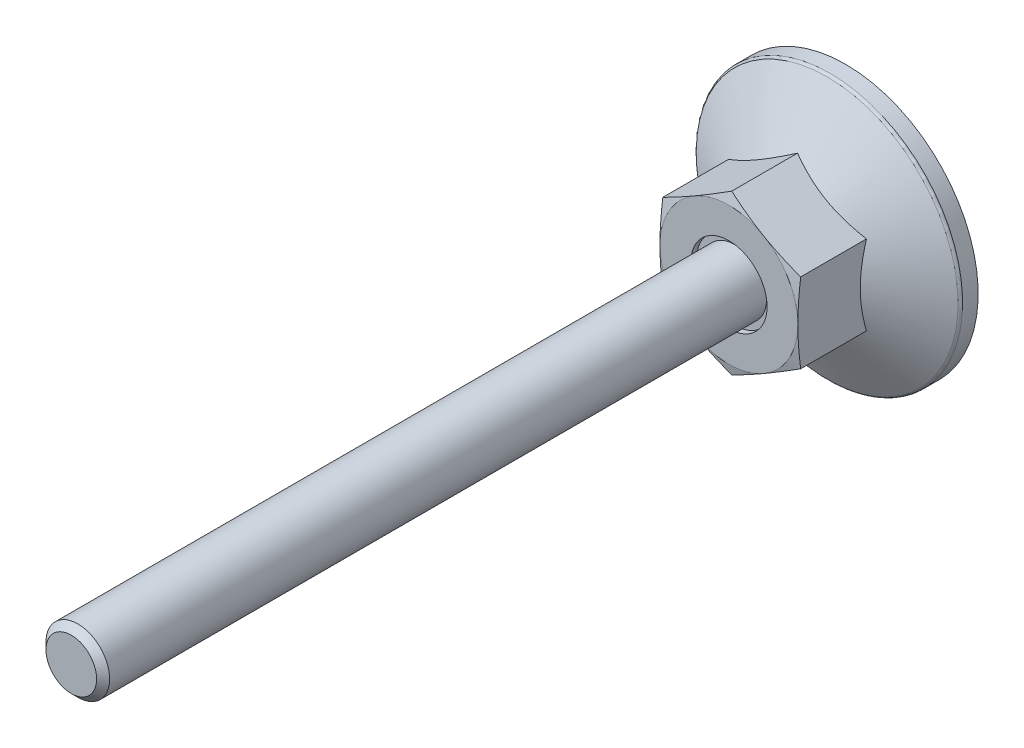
ISO-10303-21;
HEADER;
FILE_DESCRIPTION(('STEP AP214'),'2;1');
FILE_NAME('part.step','',(''),(''),'','','');
FILE_SCHEMA(('AUTOMOTIVE_DESIGN { 1 0 10303 214 1 1 1 1 }'));
ENDSEC;
DATA;
#1=APPLICATION_CONTEXT('core data for automotive mechanical design processes');
#2=APPLICATION_PROTOCOL_DEFINITION('international standard','automotive_design',2000,#1);
#3=PRODUCT_CONTEXT('',#1,'mechanical');
#4=PRODUCT('Part','Part','',(#3));
#5=PRODUCT_RELATED_PRODUCT_CATEGORY('part','',(#4));
#6=PRODUCT_DEFINITION_FORMATION('','',#4);
#7=PRODUCT_DEFINITION_CONTEXT('part definition',#1,'design');
#8=PRODUCT_DEFINITION('design','',#6,#7);
#9=PRODUCT_DEFINITION_SHAPE('','',#8);
#10=(LENGTH_UNIT() NAMED_UNIT(*) SI_UNIT(.MILLI.,.METRE.));
#11=(NAMED_UNIT(*) PLANE_ANGLE_UNIT() SI_UNIT($,.RADIAN.));
#12=(NAMED_UNIT(*) SI_UNIT($,.STERADIAN.) SOLID_ANGLE_UNIT());
#13=UNCERTAINTY_MEASURE_WITH_UNIT(LENGTH_MEASURE(1.E-05),#10,'distance_accuracy_value','');
#14=(GEOMETRIC_REPRESENTATION_CONTEXT(3) GLOBAL_UNCERTAINTY_ASSIGNED_CONTEXT((#13)) GLOBAL_UNIT_ASSIGNED_CONTEXT((#10,
#11,#12)) REPRESENTATION_CONTEXT('',''));
#15=CARTESIAN_POINT('',(0.,0.,0.));
#16=DIRECTION('',(0.,0.,1.));
#17=DIRECTION('',(1.,0.,0.));
#18=AXIS2_PLACEMENT_3D('',#15,#16,#17);
#19=CARTESIAN_POINT('',(0.,0.,10.45));
#20=DIRECTION('',(0.,0.,-1.));
#21=DIRECTION('',(0.,1.,0.));
#22=AXIS2_PLACEMENT_3D('',#19,#20,#21);
#23=PLANE('',#22);
#24=CARTESIAN_POINT('',(0.,0.,10.45));
#25=DIRECTION('',(0.,0.,-1.));
#26=DIRECTION('',(0.,1.,0.));
#27=AXIS2_PLACEMENT_3D('',#24,#25,#26);
#28=CIRCLE('',#27,3.6);
#29=CARTESIAN_POINT('',(0.,3.6,10.45));
#30=VERTEX_POINT('',#29);
#31=EDGE_CURVE('E27',#30,#30,#28,.T.);
#32=ORIENTED_EDGE('',*,*,#31,.F.);
#33=EDGE_LOOP('',(#32));
#34=FACE_BOUND('',#33,.T.);
#35=CARTESIAN_POINT('',(0.,0.,10.45));
#36=DIRECTION('',(0.,0.,-1.));
#37=DIRECTION('',(0.,1.,0.));
#38=AXIS2_PLACEMENT_3D('',#35,#36,#37);
#39=CIRCLE('',#38,3.);
#40=CARTESIAN_POINT('',(0.,3.,10.45));
#41=VERTEX_POINT('',#40);
#42=EDGE_CURVE('E252',#41,#41,#39,.F.);
#43=ORIENTED_EDGE('',*,*,#42,.F.);
#44=EDGE_LOOP('',(#43));
#45=FACE_BOUND('',#44,.T.);
#46=ADVANCED_FACE('F14',(#34,#45),#23,.F.);
#47=CARTESIAN_POINT('',(0.,7.5055534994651,22.));
#48=DIRECTION('',(0.499999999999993,-0.866025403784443,0.));
#49=DIRECTION('',(0.866025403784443,0.499999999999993,0.));
#50=AXIS2_PLACEMENT_3D('',#47,#48,#49);
#51=PLANE('',#50);
#52=CARTESIAN_POINT('',(-6.5002,3.75266127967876,4.53347836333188));
#53=CARTESIAN_POINT('',(-6.35732254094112,3.83515161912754,4.58109719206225));
#54=CARTESIAN_POINT('',(-6.21391236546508,3.91794952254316,4.62655491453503));
#55=CARTESIAN_POINT('',(-5.9259273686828,4.08421773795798,4.71255293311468));
#56=CARTESIAN_POINT('',(-5.78135207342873,4.16768832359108,4.7530911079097));
#57=CARTESIAN_POINT('',(-5.34531134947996,4.41943655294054,4.86653061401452));
#58=CARTESIAN_POINT('',(-5.05212471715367,4.58870793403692,4.93105380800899));
#59=CARTESIAN_POINT('',(-4.61337625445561,4.84201947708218,5.00671503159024));
#60=CARTESIAN_POINT('',(-4.46912536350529,4.92530276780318,5.02826875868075));
#61=CARTESIAN_POINT('',(-4.17997178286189,5.09224566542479,5.06441130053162));
#62=CARTESIAN_POINT('',(-4.03506915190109,5.17590523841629,5.07900073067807));
#63=CARTESIAN_POINT('',(-3.74501222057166,5.34336968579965,5.10084286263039));
#64=CARTESIAN_POINT('',(-3.59985839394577,5.42717428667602,5.10810389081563));
#65=CARTESIAN_POINT('',(-3.30942466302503,5.59485627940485,5.11514131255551));
#66=CARTESIAN_POINT('',(-3.16414476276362,5.67873366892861,5.11491793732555));
#67=CARTESIAN_POINT('',(-2.76612405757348,5.90853103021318,5.1040181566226));
#68=CARTESIAN_POINT('',(-2.51351353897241,6.05437578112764,5.08571979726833));
#69=CARTESIAN_POINT('',(-2.00997032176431,6.34509659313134,5.02769527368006));
#70=CARTESIAN_POINT('',(-1.75903939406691,6.48997163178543,4.9879492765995));
#71=CARTESIAN_POINT('',(-1.25448277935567,6.78127752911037,4.8885957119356));
#72=CARTESIAN_POINT('',(-1.00092075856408,6.92767163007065,4.82856718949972));
#73=CARTESIAN_POINT('',(-0.497578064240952,7.21827667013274,4.69232662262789));
#74=CARTESIAN_POINT('',(-0.247790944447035,7.36249133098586,4.61614658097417));
#75=CARTESIAN_POINT('',(0.000200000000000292,7.50566896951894,4.53347836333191));
#76=B_SPLINE_CURVE_WITH_KNOTS('',3,(#52,#53,#54,#55,#56,#57,#58,#59,#60,#61,#62,#63,#64,#65,#66,
#67,#68,#69,#70,#71,#72,#73,#74,#75),.UNSPECIFIED.,.F.,.F.,(4,2,2,2,2,2,2,2,2,2,2,4),(0.,
0.515105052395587,1.03043143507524,2.06322554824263,2.56697389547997,3.07067772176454,
3.57380860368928,4.07692394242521,4.95279354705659,5.82947446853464,6.72559912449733,
7.61996451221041),.UNSPECIFIED.);
#77=CARTESIAN_POINT('',(-6.5,3.7527767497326,4.53354503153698));
#78=VERTEX_POINT('',#77);
#79=CARTESIAN_POINT('',(0.,7.5055534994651,4.53354503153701));
#80=VERTEX_POINT('',#79);
#81=EDGE_CURVE('E100',#78,#80,#76,.T.);
#82=ORIENTED_EDGE('',*,*,#81,.F.);
#83=DIRECTION('',(0.,0.,-1.));
#84=VECTOR('',#83,1.);
#85=CARTESIAN_POINT('',(-6.5,3.7527767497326,22.));
#86=LINE('',#85,#84);
#87=CARTESIAN_POINT('',(-6.5,3.7527767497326,10.7305627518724));
#88=VERTEX_POINT('',#87);
#89=EDGE_CURVE('E91',#88,#78,#86,.T.);
#90=ORIENTED_EDGE('',*,*,#89,.F.);
#91=CARTESIAN_POINT('',(0.000200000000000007,7.50566896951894,10.7305318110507));
#92=CARTESIAN_POINT('',(-0.269745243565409,7.34981601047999,10.7723102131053));
#93=CARTESIAN_POINT('',(-0.540179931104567,7.19368047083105,10.8102381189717));
#94=CARTESIAN_POINT('',(-1.08200437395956,6.8808579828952,10.876873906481));
#95=CARTESIAN_POINT('',(-1.35339447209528,6.72417083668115,10.9055780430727));
#96=CARTESIAN_POINT('',(-1.89548428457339,6.41119513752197,10.952090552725));
#97=CARTESIAN_POINT('',(-2.16618033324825,6.25490870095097,10.9699543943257));
#98=CARTESIAN_POINT('',(-2.70791763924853,5.94213652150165,10.9939079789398));
#99=CARTESIAN_POINT('',(-2.97895881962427,5.78565082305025,11.));
#100=CARTESIAN_POINT('',(-3.52104118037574,5.47267942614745,11.));
#101=CARTESIAN_POINT('',(-3.79208236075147,5.31619372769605,10.9939079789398));
#102=CARTESIAN_POINT('',(-4.33381966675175,5.00342154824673,10.9699543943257));
#103=CARTESIAN_POINT('',(-4.60451571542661,4.84713511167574,10.952090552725));
#104=CARTESIAN_POINT('',(-5.14660552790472,4.53415941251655,10.9055780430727));
#105=CARTESIAN_POINT('',(-5.41799562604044,4.3774722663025,10.876873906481));
#106=CARTESIAN_POINT('',(-5.95982006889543,4.06464977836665,10.8102381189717));
#107=CARTESIAN_POINT('',(-6.23025475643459,3.90851423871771,10.7723102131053));
#108=CARTESIAN_POINT('',(-6.5002,3.75266127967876,10.7305318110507));
#109=B_SPLINE_CURVE_WITH_KNOTS('',3,(#91,#92,#93,#94,#95,#96,#97,#98,#99,#100,#101,#102,#103,
#104,#105,#106,#107,#108),.UNSPECIFIED.,.F.,.F.,(4,2,2,2,2,2,2,2,4),(0.,0.943529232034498,
1.88744107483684,2.82648138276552,3.76533995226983,4.70419852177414,5.64323882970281,
6.58715067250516,7.53067990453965),.UNSPECIFIED.);
#110=CARTESIAN_POINT('',(-3.24999999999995,5.62916512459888,11.));
#111=VERTEX_POINT('',#110);
#112=EDGE_CURVE('E191',#111,#88,#109,.T.);
#113=ORIENTED_EDGE('',*,*,#112,.F.);
#114=CARTESIAN_POINT('',(0.,7.5055534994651,10.7305627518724));
#115=VERTEX_POINT('',#114);
#116=EDGE_CURVE('E478',#115,#111,#109,.T.);
#117=ORIENTED_EDGE('',*,*,#116,.F.);
#118=DIRECTION('',(0.,0.,-1.));
#119=VECTOR('',#118,1.);
#120=CARTESIAN_POINT('',(0.,7.5055534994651,22.));
#121=LINE('',#120,#119);
#122=EDGE_CURVE('E104',#115,#80,#121,.T.);
#123=ORIENTED_EDGE('',*,*,#122,.T.);
#124=EDGE_LOOP('',(#82,#90,#113,#117,#123));
#125=FACE_BOUND('',#124,.T.);
#126=ADVANCED_FACE('F103',(#125),#51,.F.);
#127=CARTESIAN_POINT('',(6.5,3.7527767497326,22.));
#128=DIRECTION('',(-0.499999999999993,-0.866025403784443,0.));
#129=DIRECTION('',(0.866025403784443,-0.499999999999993,0.));
#130=AXIS2_PLACEMENT_3D('',#127,#128,#129);
#131=PLANE('',#130);
#132=CARTESIAN_POINT('',(-0.0002,7.50566896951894,4.53347836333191));
#133=CARTESIAN_POINT('',(0.142677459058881,7.42317863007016,4.58109719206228));
#134=CARTESIAN_POINT('',(0.286087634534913,7.34038072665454,4.62655491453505));
#135=CARTESIAN_POINT('',(0.574072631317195,7.17411251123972,4.71255293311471));
#136=CARTESIAN_POINT('',(0.718647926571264,7.09064192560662,4.75309110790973));
#137=CARTESIAN_POINT('',(1.15468865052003,6.83889369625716,4.86653061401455));
#138=CARTESIAN_POINT('',(1.44787528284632,6.66962231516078,4.93105380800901));
#139=CARTESIAN_POINT('',(1.88662374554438,6.41631077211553,5.00671503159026));
#140=CARTESIAN_POINT('',(2.03087463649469,6.33302748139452,5.02826875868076));
#141=CARTESIAN_POINT('',(2.32002821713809,6.16608458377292,5.06441130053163));
#142=CARTESIAN_POINT('',(2.46493084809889,6.08242501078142,5.07900073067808));
#143=CARTESIAN_POINT('',(2.75498777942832,5.91496056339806,5.10084286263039));
#144=CARTESIAN_POINT('',(2.90014160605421,5.8311559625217,5.10810389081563));
#145=CARTESIAN_POINT('',(3.19057533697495,5.66347396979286,5.11514131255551));
#146=CARTESIAN_POINT('',(3.33585523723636,5.5795965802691,5.11491793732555));
#147=CARTESIAN_POINT('',(3.73387594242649,5.34979921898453,5.10401815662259));
#148=CARTESIAN_POINT('',(3.98648646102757,5.20395446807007,5.08571979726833));
#149=CARTESIAN_POINT('',(4.49002967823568,4.91323365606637,5.02769527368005));
#150=CARTESIAN_POINT('',(4.74096060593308,4.76835861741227,4.98794927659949));
#151=CARTESIAN_POINT('',(5.24551722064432,4.47705272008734,4.88859571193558));
#152=CARTESIAN_POINT('',(5.49907924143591,4.33065861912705,4.8285671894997));
#153=CARTESIAN_POINT('',(6.00242193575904,4.04005357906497,4.69232662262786));
#154=CARTESIAN_POINT('',(6.25220905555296,3.89583891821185,4.61614658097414));
#155=CARTESIAN_POINT('',(6.5002,3.75266127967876,4.53347836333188));
#156=B_SPLINE_CURVE_WITH_KNOTS('',3,(#132,#133,#134,#135,#136,#137,#138,#139,#140,#141,#142,
#143,#144,#145,#146,#147,#148,#149,#150,#151,#152,#153,#154,#155),.UNSPECIFIED.,.F.,.F.,(4,2,2,
2,2,2,2,2,2,2,2,4),(0.,0.515105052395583,1.03043143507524,2.06322554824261,2.56697389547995,
3.07067772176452,3.57380860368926,4.07692394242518,4.95279354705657,5.82947446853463,
6.72559912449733,7.61996451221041),.UNSPECIFIED.);
#157=CARTESIAN_POINT('',(6.5,3.7527767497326,4.53354503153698));
#158=VERTEX_POINT('',#157);
#159=EDGE_CURVE('E34',#80,#158,#156,.T.);
#160=ORIENTED_EDGE('',*,*,#159,.F.);
#161=ORIENTED_EDGE('',*,*,#122,.F.);
#162=CARTESIAN_POINT('',(6.5002,3.75266127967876,10.7305318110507));
#163=CARTESIAN_POINT('',(6.23025475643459,3.90851423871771,10.7723102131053));
#164=CARTESIAN_POINT('',(5.95982006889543,4.06464977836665,10.8102381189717));
#165=CARTESIAN_POINT('',(5.41799562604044,4.37747226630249,10.876873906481));
#166=CARTESIAN_POINT('',(5.14660552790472,4.53415941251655,10.9055780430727));
#167=CARTESIAN_POINT('',(4.60451571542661,4.84713511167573,10.952090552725));
#168=CARTESIAN_POINT('',(4.33381966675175,5.00342154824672,10.9699543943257));
#169=CARTESIAN_POINT('',(3.79208236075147,5.31619372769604,10.9939079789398));
#170=CARTESIAN_POINT('',(3.52104118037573,5.47267942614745,11.));
#171=CARTESIAN_POINT('',(2.97895881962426,5.78565082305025,11.));
#172=CARTESIAN_POINT('',(2.70791763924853,5.94213652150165,10.9939079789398));
#173=CARTESIAN_POINT('',(2.16618033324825,6.25490870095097,10.9699543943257));
#174=CARTESIAN_POINT('',(1.89548428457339,6.41119513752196,10.952090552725));
#175=CARTESIAN_POINT('',(1.35339447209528,6.72417083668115,10.9055780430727));
#176=CARTESIAN_POINT('',(1.08200437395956,6.8808579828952,10.876873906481));
#177=CARTESIAN_POINT('',(0.540179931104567,7.19368047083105,10.8102381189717));
#178=CARTESIAN_POINT('',(0.26974524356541,7.34981601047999,10.7723102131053));
#179=CARTESIAN_POINT('',(-0.000199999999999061,7.50566896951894,10.7305318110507));
#180=B_SPLINE_CURVE_WITH_KNOTS('',3,(#162,#163,#164,#165,#166,#167,#168,#169,#170,#171,#172,
#173,#174,#175,#176,#177,#178,#179),.UNSPECIFIED.,.F.,.F.,(4,2,2,2,2,2,2,2,4),(0.,
0.943529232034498,1.88744107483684,2.82648138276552,3.76533995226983,4.70419852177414,
5.64323882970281,6.58715067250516,7.53067990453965),.UNSPECIFIED.);
#181=CARTESIAN_POINT('',(3.24999999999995,5.62916512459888,11.));
#182=VERTEX_POINT('',#181);
#183=EDGE_CURVE('E175',#182,#115,#180,.T.);
#184=ORIENTED_EDGE('',*,*,#183,.F.);
#185=CARTESIAN_POINT('',(6.5,3.7527767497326,10.7305627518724));
#186=VERTEX_POINT('',#185);
#187=EDGE_CURVE('E183',#186,#182,#180,.T.);
#188=ORIENTED_EDGE('',*,*,#187,.F.);
#189=DIRECTION('',(0.,0.,-1.));
#190=VECTOR('',#189,1.);
#191=CARTESIAN_POINT('',(6.5,3.7527767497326,22.));
#192=LINE('',#191,#190);
#193=EDGE_CURVE('E481',#186,#158,#192,.T.);
#194=ORIENTED_EDGE('',*,*,#193,.T.);
#195=EDGE_LOOP('',(#160,#161,#184,#188,#194));
#196=FACE_BOUND('',#195,.T.);
#197=ADVANCED_FACE('F165',(#196),#131,.F.);
#198=CARTESIAN_POINT('',(6.5,-3.7527767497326,22.));
#199=DIRECTION('',(-1.,0.,0.));
#200=DIRECTION('',(0.,-1.,0.));
#201=AXIS2_PLACEMENT_3D('',#198,#199,#200);
#202=PLANE('',#201);
#203=CARTESIAN_POINT('',(6.5,10.067414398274,1.94823609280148));
#204=CARTESIAN_POINT('',(6.5,9.78352438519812,2.0858958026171));
#205=CARTESIAN_POINT('',(6.5,9.49898106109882,2.22223138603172));
#206=CARTESIAN_POINT('',(6.5,8.9282401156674,2.49150895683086));
#207=CARTESIAN_POINT('',(6.5,8.64204224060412,2.62445040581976));
#208=CARTESIAN_POINT('',(6.5,8.06616487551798,2.88686541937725));
#209=CARTESIAN_POINT('',(6.5,7.77647490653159,3.01631606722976));
#210=CARTESIAN_POINT('',(6.5,7.19478507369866,3.26989907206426));
#211=CARTESIAN_POINT('',(6.5,6.90278532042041,3.3940316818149));
#212=CARTESIAN_POINT('',(6.5,6.30684739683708,3.6393457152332));
#213=CARTESIAN_POINT('',(6.5,6.00282105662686,3.76031411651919));
#214=CARTESIAN_POINT('',(6.5,5.39120706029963,3.99306391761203));
#215=CARTESIAN_POINT('',(6.5,5.08361900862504,4.10484428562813));
#216=CARTESIAN_POINT('',(6.5,4.46497231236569,4.31627594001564));
#217=CARTESIAN_POINT('',(6.5,4.15392216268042,4.41595183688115));
#218=CARTESIAN_POINT('',(6.5,3.52735818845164,4.59996747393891));
#219=CARTESIAN_POINT('',(6.5,3.21184580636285,4.6843120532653));
#220=CARTESIAN_POINT('',(6.5,2.57783458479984,4.83319256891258));
#221=CARTESIAN_POINT('',(6.5,2.25935972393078,4.8978289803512));
#222=CARTESIAN_POINT('',(6.5,1.61842059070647,5.00357646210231));
#223=CARTESIAN_POINT('',(6.5,1.29595672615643,5.04468991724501));
#224=CARTESIAN_POINT('',(6.5,0.812693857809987,5.08598811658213));
#225=CARTESIAN_POINT('',(6.5,0.652724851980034,5.09635596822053));
#226=CARTESIAN_POINT('',(6.5,0.332484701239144,5.110324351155));
#227=CARTESIAN_POINT('',(6.5,0.172213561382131,5.11392499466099));
#228=CARTESIAN_POINT('',(6.5,-0.148338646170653,5.11426557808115));
#229=CARTESIAN_POINT('',(6.5,-0.308619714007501,5.11100536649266));
#230=CARTESIAN_POINT('',(6.5,-0.628902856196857,5.09770543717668));
#231=CARTESIAN_POINT('',(6.5,-0.788904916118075,5.08766537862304));
#232=CARTESIAN_POINT('',(6.5,-1.1736673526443,5.05558094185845));
#233=CARTESIAN_POINT('',(6.5,-1.39816400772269,5.03030719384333));
#234=CARTESIAN_POINT('',(6.5,-1.84547349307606,4.96779217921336));
#235=CARTESIAN_POINT('',(6.5,-2.06828609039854,4.93054928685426));
#236=CARTESIAN_POINT('',(6.5,-2.73393776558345,4.80284369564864));
#237=CARTESIAN_POINT('',(6.5,-3.17375537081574,4.69642628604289));
#238=CARTESIAN_POINT('',(6.5,-3.83171733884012,4.51203063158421));
#239=CARTESIAN_POINT('',(6.5,-4.0532725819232,4.44552609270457));
#240=CARTESIAN_POINT('',(6.5,-4.49422901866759,4.30565892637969));
#241=CARTESIAN_POINT('',(6.5,-4.7136301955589,4.23229624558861));
#242=CARTESIAN_POINT('',(6.5,-5.15035386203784,4.07988627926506));
#243=CARTESIAN_POINT('',(6.5,-5.36767698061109,4.00084077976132));
#244=CARTESIAN_POINT('',(6.5,-5.800520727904,3.83799065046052));
#245=CARTESIAN_POINT('',(6.5,-6.01604140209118,3.75418614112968));
#246=CARTESIAN_POINT('',(6.5,-6.61842771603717,3.5135303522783));
#247=CARTESIAN_POINT('',(6.5,-7.00350435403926,3.35220459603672));
#248=CARTESIAN_POINT('',(6.5,-7.76959629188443,3.02014813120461));
#249=CARTESIAN_POINT('',(6.5,-8.15061109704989,2.84941629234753));
#250=CARTESIAN_POINT('',(6.5,-8.90957192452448,2.50088582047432));
#251=CARTESIAN_POINT('',(6.5,-9.28751663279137,2.32308433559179));
#252=CARTESIAN_POINT('',(6.5,-10.0408394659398,1.96218611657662));
#253=CARTESIAN_POINT('',(6.5,-10.4162177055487,1.77908962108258));
#254=CARTESIAN_POINT('',(6.5,-11.1655631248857,1.40849620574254));
#255=CARTESIAN_POINT('',(6.5,-11.5395269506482,1.22099251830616));
#256=CARTESIAN_POINT('',(6.5,-12.2858210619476,0.842758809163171));
#257=CARTESIAN_POINT('',(6.5,-12.6581513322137,0.652028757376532));
#258=CARTESIAN_POINT('',(6.5,-13.4013949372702,0.268043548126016));
#259=CARTESIAN_POINT('',(6.5,-13.7723085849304,0.0747889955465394));
#260=CARTESIAN_POINT('',(6.5,-14.5130449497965,-0.313800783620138));
#261=CARTESIAN_POINT('',(6.5,-14.8828676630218,-0.509136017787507));
#262=CARTESIAN_POINT('',(6.5,-15.9085714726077,-1.05391022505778));
#263=CARTESIAN_POINT('',(6.5,-16.5634819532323,-1.40517623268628));
#264=CARTESIAN_POINT('',(6.5,-17.871267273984,-2.11157255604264));
#265=CARTESIAN_POINT('',(6.5,-18.5241419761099,-2.46670312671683));
#266=CARTESIAN_POINT('',(6.5,-19.8261496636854,-3.17862531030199));
#267=CARTESIAN_POINT('',(6.5,-20.4752878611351,-3.53540739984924));
#268=CARTESIAN_POINT('',(6.5,-21.7722968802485,-4.25114422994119));
#269=CARTESIAN_POINT('',(6.5,-22.4201678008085,-4.61009879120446));
#270=CARTESIAN_POINT('',(6.5,-23.0675997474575,-4.9698379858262));
#271=B_SPLINE_CURVE_WITH_KNOTS('',3,(#203,#204,#205,#206,#207,#208,#209,#210,#211,#212,#213,
#214,#215,#216,#217,#218,#219,#220,#221,#222,#223,#224,#225,#226,#227,#228,#229,#230,#231,#232,
#233,#234,#235,#236,#237,#238,#239,#240,#241,#242,#243,#244,#245,#246,#247,#248,#249,#250,#251,
#252,#253,#254,#255,#256,#257,#258,#259,#260,#261,#262,#263,#264,#265,#266,#267,#268,#269,#270),
.UNSPECIFIED.,.F.,.F.,(4,2,2,2,2,2,2,2,2,2,2,2,2,2,2,2,2,2,2,2,2,2,2,2,2,2,2,2,2,2,2,2,2,4),(0.,
0.94652822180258,1.89320566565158,2.84505559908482,3.79686024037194,4.77837094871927,
5.75999172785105,6.73958204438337,7.71886262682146,8.69306383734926,9.66716626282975,
10.1479587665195,10.6287432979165,11.1095384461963,11.5903577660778,12.267719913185,
12.9451741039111,14.3007885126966,14.9946950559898,15.6886069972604,16.3823017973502,
17.0759790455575,18.3282990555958,19.5807698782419,20.8337511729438,22.086676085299,
23.3416700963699,24.5966758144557,25.8513861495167,27.1061010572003,29.3355785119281,
31.5652039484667,33.7873748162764,36.0093647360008),.UNSPECIFIED.);
#272=CARTESIAN_POINT('',(6.5,-3.7527767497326,4.53354503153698));
#273=VERTEX_POINT('',#272);
#274=EDGE_CURVE('E42',#158,#273,#271,.T.);
#275=ORIENTED_EDGE('',*,*,#274,.F.);
#276=ORIENTED_EDGE('',*,*,#193,.F.);
#277=CARTESIAN_POINT('',(6.5,9.92747995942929,9.56215186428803));
#278=CARTESIAN_POINT('',(6.5,9.63259364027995,9.62823955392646));
#279=CARTESIAN_POINT('',(6.5,9.33752287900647,9.69351898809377));
#280=CARTESIAN_POINT('',(6.5,8.74692189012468,9.82202506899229));
#281=CARTESIAN_POINT('',(6.5,8.45139164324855,9.88525162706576));
#282=CARTESIAN_POINT('',(6.5,7.85951636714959,10.0092707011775));
#283=CARTESIAN_POINT('',(6.5,7.56317082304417,10.0700607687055));
#284=CARTESIAN_POINT('',(6.5,6.9698629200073,10.1885506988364));
#285=CARTESIAN_POINT('',(6.5,6.67290056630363,10.2462505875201));
#286=CARTESIAN_POINT('',(6.5,6.08062010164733,10.3573796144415));
#287=CARTESIAN_POINT('',(6.5,5.78530770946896,10.410839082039));
#288=CARTESIAN_POINT('',(6.5,5.19387740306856,10.5130907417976));
#289=CARTESIAN_POINT('',(6.5,4.89775950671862,10.5618830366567));
#290=CARTESIAN_POINT('',(6.5,4.30466070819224,10.6537017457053));
#291=CARTESIAN_POINT('',(6.5,4.00767991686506,10.69672886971));
#292=CARTESIAN_POINT('',(6.5,3.41277328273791,10.7757492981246));
#293=CARTESIAN_POINT('',(6.5,3.11484743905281,10.8117425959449));
#294=CARTESIAN_POINT('',(6.5,2.51468954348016,10.8756761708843));
#295=CARTESIAN_POINT('',(6.5,2.21244707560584,10.9035201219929));
#296=CARTESIAN_POINT('',(6.5,1.60720229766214,10.9492341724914));
#297=CARTESIAN_POINT('',(6.5,1.30420000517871,10.9671045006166));
#298=CARTESIAN_POINT('',(6.5,0.697875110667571,10.9918290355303));
#299=CARTESIAN_POINT('',(6.5,0.394552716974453,10.9986882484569));
#300=CARTESIAN_POINT('',(6.5,-0.212135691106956,11.0009688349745));
#301=CARTESIAN_POINT('',(6.5,-0.515501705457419,10.9963902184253));
#302=CARTESIAN_POINT('',(6.5,-1.1229550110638,10.9760526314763));
#303=CARTESIAN_POINT('',(6.5,-1.42704091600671,10.9602530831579));
#304=CARTESIAN_POINT('',(6.5,-2.03449758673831,10.918375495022));
#305=CARTESIAN_POINT('',(6.5,-2.33786833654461,10.892297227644));
#306=CARTESIAN_POINT('',(6.5,-2.94389214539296,10.8311794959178));
#307=CARTESIAN_POINT('',(6.5,-3.24654460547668,10.7961341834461));
#308=CARTESIAN_POINT('',(6.5,-3.85087551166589,10.7185406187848));
#309=CARTESIAN_POINT('',(6.5,-4.15255395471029,10.6759923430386));
#310=CARTESIAN_POINT('',(6.5,-4.73502363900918,10.5877746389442));
#311=CARTESIAN_POINT('',(6.5,-5.01587505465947,10.5424985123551));
#312=CARTESIAN_POINT('',(6.5,-5.57683763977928,10.4475514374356));
#313=CARTESIAN_POINT('',(6.5,-5.85694878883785,10.3978803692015));
#314=CARTESIAN_POINT('',(6.5,-6.41653333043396,10.2949474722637));
#315=CARTESIAN_POINT('',(6.5,-6.69600666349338,10.2416853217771));
#316=CARTESIAN_POINT('',(6.5,-7.25437933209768,10.132225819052));
#317=CARTESIAN_POINT('',(6.5,-7.53327866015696,10.0760284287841));
#318=CARTESIAN_POINT('',(6.5,-8.36936246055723,9.90383082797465));
#319=CARTESIAN_POINT('',(6.5,-8.9258084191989,9.78424858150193));
#320=CARTESIAN_POINT('',(6.5,-10.0372205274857,9.53861051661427));
#321=CARTESIAN_POINT('',(6.5,-10.5921867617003,9.41255507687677));
#322=CARTESIAN_POINT('',(6.5,-11.6956125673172,9.15714489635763));
#323=CARTESIAN_POINT('',(6.5,-12.244082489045,9.02783474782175));
#324=CARTESIAN_POINT('',(6.5,-13.3402571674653,8.76597711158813));
#325=CARTESIAN_POINT('',(6.5,-13.8879619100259,8.6334295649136));
#326=CARTESIAN_POINT('',(6.5,-14.9821103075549,8.36610757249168));
#327=CARTESIAN_POINT('',(6.5,-15.528554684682,8.23133607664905));
#328=CARTESIAN_POINT('',(6.5,-16.6209674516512,7.95995280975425));
#329=CARTESIAN_POINT('',(6.5,-17.1669358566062,7.82334109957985));
#330=CARTESIAN_POINT('',(6.5,-17.7127383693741,7.6860776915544));
#331=B_SPLINE_CURVE_WITH_KNOTS('',3,(#277,#278,#279,#280,#281,#282,#283,#284,#285,#286,#287,
#288,#289,#290,#291,#292,#293,#294,#295,#296,#297,#298,#299,#300,#301,#302,#303,#304,#305,#306,
#307,#308,#309,#310,#311,#312,#313,#314,#315,#316,#317,#318,#319,#320,#321,#322,#323,#324,#325,
#326,#327,#328,#329,#330),.UNSPECIFIED.,.F.,.F.,(4,2,2,2,2,2,2,2,2,2,2,2,2,2,2,2,2,2,2,2,2,2,2,
2,2,2,4),(0.,0.906607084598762,1.8132532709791,2.72078883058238,3.62831672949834,
4.52862337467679,5.42891020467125,6.32908608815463,7.22926281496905,8.13968571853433,
9.05008774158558,9.96007573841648,10.8700629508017,11.7833577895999,12.6966728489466,
13.6105850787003,14.5245001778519,15.3778915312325,16.2313061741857,17.084797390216,
17.9382996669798,19.6456836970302,21.3529679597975,23.0434756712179,24.7340142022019,
26.4224665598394,28.1108631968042),.UNSPECIFIED.);
#332=CARTESIAN_POINT('',(6.5,0.,11.));
#333=VERTEX_POINT('',#332);
#334=EDGE_CURVE('E185',#333,#186,#331,.F.);
#335=ORIENTED_EDGE('',*,*,#334,.F.);
#336=CARTESIAN_POINT('',(6.5,-3.7527767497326,10.7305627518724));
#337=VERTEX_POINT('',#336);
#338=EDGE_CURVE('E184',#337,#333,#331,.F.);
#339=ORIENTED_EDGE('',*,*,#338,.F.);
#340=DIRECTION('',(0.,0.,-1.));
#341=VECTOR('',#340,1.);
#342=CARTESIAN_POINT('',(6.5,-3.7527767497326,22.));
#343=LINE('',#342,#341);
#344=EDGE_CURVE('E453',#337,#273,#343,.T.);
#345=ORIENTED_EDGE('',*,*,#344,.T.);
#346=EDGE_LOOP('',(#275,#276,#335,#339,#345));
#347=FACE_BOUND('',#346,.T.);
#348=ADVANCED_FACE('F169',(#347),#202,.F.);
#349=CARTESIAN_POINT('',(0.,-7.5055534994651,22.));
#350=DIRECTION('',(-0.499999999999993,0.866025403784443,0.));
#351=DIRECTION('',(-0.866025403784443,-0.499999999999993,0.));
#352=AXIS2_PLACEMENT_3D('',#349,#350,#351);
#353=PLANE('',#352);
#354=CARTESIAN_POINT('',(6.5002,-3.75266127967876,4.53347836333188));
#355=CARTESIAN_POINT('',(6.35732254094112,-3.83515161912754,4.58109719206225));
#356=CARTESIAN_POINT('',(6.21391236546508,-3.91794952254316,4.62655491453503));
#357=CARTESIAN_POINT('',(5.9259273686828,-4.08421773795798,4.71255293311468));
#358=CARTESIAN_POINT('',(5.78135207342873,-4.16768832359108,4.7530911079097));
#359=CARTESIAN_POINT('',(5.34531134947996,-4.41943655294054,4.86653061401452));
#360=CARTESIAN_POINT('',(5.05212471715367,-4.58870793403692,4.93105380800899));
#361=CARTESIAN_POINT('',(4.61337625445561,-4.84201947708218,5.00671503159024));
#362=CARTESIAN_POINT('',(4.46912536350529,-4.92530276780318,5.02826875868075));
#363=CARTESIAN_POINT('',(4.17997178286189,-5.09224566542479,5.06441130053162));
#364=CARTESIAN_POINT('',(4.03506915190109,-5.17590523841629,5.07900073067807));
#365=CARTESIAN_POINT('',(3.74501222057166,-5.34336968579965,5.10084286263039));
#366=CARTESIAN_POINT('',(3.59985839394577,-5.42717428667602,5.10810389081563));
#367=CARTESIAN_POINT('',(3.30942466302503,-5.59485627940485,5.11514131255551));
#368=CARTESIAN_POINT('',(3.16414476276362,-5.67873366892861,5.11491793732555));
#369=CARTESIAN_POINT('',(2.76612405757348,-5.90853103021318,5.1040181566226));
#370=CARTESIAN_POINT('',(2.51351353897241,-6.05437578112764,5.08571979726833));
#371=CARTESIAN_POINT('',(2.00997032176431,-6.34509659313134,5.02769527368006));
#372=CARTESIAN_POINT('',(1.75903939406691,-6.48997163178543,4.9879492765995));
#373=CARTESIAN_POINT('',(1.25448277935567,-6.78127752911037,4.8885957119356));
#374=CARTESIAN_POINT('',(1.00092075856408,-6.92767163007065,4.82856718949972));
#375=CARTESIAN_POINT('',(0.497578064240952,-7.21827667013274,4.69232662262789));
#376=CARTESIAN_POINT('',(0.247790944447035,-7.36249133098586,4.61614658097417));
#377=CARTESIAN_POINT('',(-0.000200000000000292,-7.50566896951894,4.53347836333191));
#378=B_SPLINE_CURVE_WITH_KNOTS('',3,(#354,#355,#356,#357,#358,#359,#360,#361,#362,#363,#364,
#365,#366,#367,#368,#369,#370,#371,#372,#373,#374,#375,#376,#377),.UNSPECIFIED.,.F.,.F.,(4,2,2,
2,2,2,2,2,2,2,2,4),(0.,0.515105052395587,1.03043143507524,2.06322554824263,2.56697389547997,
3.07067772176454,3.57380860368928,4.07692394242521,4.95279354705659,5.82947446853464,
6.72559912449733,7.61996451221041),.UNSPECIFIED.);
#379=CARTESIAN_POINT('',(0.,-7.5055534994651,4.53354503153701));
#380=VERTEX_POINT('',#379);
#381=EDGE_CURVE('E112',#273,#380,#378,.T.);
#382=ORIENTED_EDGE('',*,*,#381,.F.);
#383=ORIENTED_EDGE('',*,*,#344,.F.);
#384=CARTESIAN_POINT('',(-0.000200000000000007,-7.50566896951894,10.7305318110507));
#385=CARTESIAN_POINT('',(0.269745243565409,-7.34981601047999,10.7723102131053));
#386=CARTESIAN_POINT('',(0.540179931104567,-7.19368047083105,10.8102381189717));
#387=CARTESIAN_POINT('',(1.08200437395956,-6.8808579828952,10.876873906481));
#388=CARTESIAN_POINT('',(1.35339447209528,-6.72417083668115,10.9055780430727));
#389=CARTESIAN_POINT('',(1.89548428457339,-6.41119513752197,10.952090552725));
#390=CARTESIAN_POINT('',(2.16618033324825,-6.25490870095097,10.9699543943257));
#391=CARTESIAN_POINT('',(2.70791763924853,-5.94213652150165,10.9939079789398));
#392=CARTESIAN_POINT('',(2.97895881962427,-5.78565082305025,11.));
#393=CARTESIAN_POINT('',(3.52104118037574,-5.47267942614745,11.));
#394=CARTESIAN_POINT('',(3.79208236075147,-5.31619372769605,10.9939079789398));
#395=CARTESIAN_POINT('',(4.33381966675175,-5.00342154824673,10.9699543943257));
#396=CARTESIAN_POINT('',(4.60451571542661,-4.84713511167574,10.952090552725));
#397=CARTESIAN_POINT('',(5.14660552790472,-4.53415941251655,10.9055780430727));
#398=CARTESIAN_POINT('',(5.41799562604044,-4.3774722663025,10.876873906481));
#399=CARTESIAN_POINT('',(5.95982006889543,-4.06464977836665,10.8102381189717));
#400=CARTESIAN_POINT('',(6.23025475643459,-3.90851423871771,10.7723102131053));
#401=CARTESIAN_POINT('',(6.5002,-3.75266127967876,10.7305318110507));
#402=B_SPLINE_CURVE_WITH_KNOTS('',3,(#384,#385,#386,#387,#388,#389,#390,#391,#392,#393,#394,
#395,#396,#397,#398,#399,#400,#401),.UNSPECIFIED.,.F.,.F.,(4,2,2,2,2,2,2,2,4),(0.,
0.943529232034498,1.88744107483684,2.82648138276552,3.76533995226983,4.70419852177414,
5.64323882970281,6.58715067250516,7.53067990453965),.UNSPECIFIED.);
#403=CARTESIAN_POINT('',(3.24999999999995,-5.62916512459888,11.));
#404=VERTEX_POINT('',#403);
#405=EDGE_CURVE('E222',#404,#337,#402,.T.);
#406=ORIENTED_EDGE('',*,*,#405,.F.);
#407=CARTESIAN_POINT('',(0.,-7.5055534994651,10.7305627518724));
#408=VERTEX_POINT('',#407);
#409=EDGE_CURVE('E228',#408,#404,#402,.T.);
#410=ORIENTED_EDGE('',*,*,#409,.F.);
#411=DIRECTION('',(0.,0.,-1.));
#412=VECTOR('',#411,1.);
#413=CARTESIAN_POINT('',(0.,-7.5055534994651,22.));
#414=LINE('',#413,#412);
#415=EDGE_CURVE('E483',#408,#380,#414,.T.);
#416=ORIENTED_EDGE('',*,*,#415,.T.);
#417=EDGE_LOOP('',(#382,#383,#406,#410,#416));
#418=FACE_BOUND('',#417,.T.);
#419=ADVANCED_FACE('F230',(#418),#353,.F.);
#420=CARTESIAN_POINT('',(-6.5,-3.7527767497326,22.));
#421=DIRECTION('',(0.499999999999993,0.866025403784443,0.));
#422=DIRECTION('',(-0.866025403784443,0.499999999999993,0.));
#423=AXIS2_PLACEMENT_3D('',#420,#421,#422);
#424=PLANE('',#423);
#425=CARTESIAN_POINT('',(0.0002,-7.50566896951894,4.53347836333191));
#426=CARTESIAN_POINT('',(-0.142677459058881,-7.42317863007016,4.58109719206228));
#427=CARTESIAN_POINT('',(-0.286087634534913,-7.34038072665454,4.62655491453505));
#428=CARTESIAN_POINT('',(-0.574072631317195,-7.17411251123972,4.71255293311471));
#429=CARTESIAN_POINT('',(-0.718647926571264,-7.09064192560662,4.75309110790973));
#430=CARTESIAN_POINT('',(-1.15468865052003,-6.83889369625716,4.86653061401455));
#431=CARTESIAN_POINT('',(-1.44787528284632,-6.66962231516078,4.93105380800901));
#432=CARTESIAN_POINT('',(-1.88662374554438,-6.41631077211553,5.00671503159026));
#433=CARTESIAN_POINT('',(-2.03087463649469,-6.33302748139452,5.02826875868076));
#434=CARTESIAN_POINT('',(-2.32002821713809,-6.16608458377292,5.06441130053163));
#435=CARTESIAN_POINT('',(-2.46493084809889,-6.08242501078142,5.07900073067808));
#436=CARTESIAN_POINT('',(-2.75498777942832,-5.91496056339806,5.10084286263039));
#437=CARTESIAN_POINT('',(-2.90014160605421,-5.8311559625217,5.10810389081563));
#438=CARTESIAN_POINT('',(-3.19057533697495,-5.66347396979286,5.11514131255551));
#439=CARTESIAN_POINT('',(-3.33585523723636,-5.5795965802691,5.11491793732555));
#440=CARTESIAN_POINT('',(-3.73387594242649,-5.34979921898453,5.10401815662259));
#441=CARTESIAN_POINT('',(-3.98648646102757,-5.20395446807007,5.08571979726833));
#442=CARTESIAN_POINT('',(-4.49002967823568,-4.91323365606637,5.02769527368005));
#443=CARTESIAN_POINT('',(-4.74096060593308,-4.76835861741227,4.98794927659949));
#444=CARTESIAN_POINT('',(-5.24551722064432,-4.47705272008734,4.88859571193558));
#445=CARTESIAN_POINT('',(-5.49907924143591,-4.33065861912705,4.8285671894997));
#446=CARTESIAN_POINT('',(-6.00242193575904,-4.04005357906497,4.69232662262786));
#447=CARTESIAN_POINT('',(-6.25220905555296,-3.89583891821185,4.61614658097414));
#448=CARTESIAN_POINT('',(-6.5002,-3.75266127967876,4.53347836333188));
#449=B_SPLINE_CURVE_WITH_KNOTS('',3,(#425,#426,#427,#428,#429,#430,#431,#432,#433,#434,#435,
#436,#437,#438,#439,#440,#441,#442,#443,#444,#445,#446,#447,#448),.UNSPECIFIED.,.F.,.F.,(4,2,2,
2,2,2,2,2,2,2,2,4),(0.,0.515105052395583,1.03043143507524,2.06322554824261,2.56697389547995,
3.07067772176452,3.57380860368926,4.07692394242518,4.95279354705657,5.82947446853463,
6.72559912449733,7.61996451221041),.UNSPECIFIED.);
#450=CARTESIAN_POINT('',(-6.5,-3.7527767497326,4.53354503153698));
#451=VERTEX_POINT('',#450);
#452=EDGE_CURVE('E110',#380,#451,#449,.T.);
#453=ORIENTED_EDGE('',*,*,#452,.F.);
#454=ORIENTED_EDGE('',*,*,#415,.F.);
#455=CARTESIAN_POINT('',(-6.5002,-3.75266127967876,10.7305318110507));
#456=CARTESIAN_POINT('',(-6.23025475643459,-3.90851423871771,10.7723102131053));
#457=CARTESIAN_POINT('',(-5.95982006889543,-4.06464977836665,10.8102381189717));
#458=CARTESIAN_POINT('',(-5.41799562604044,-4.37747226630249,10.876873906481));
#459=CARTESIAN_POINT('',(-5.14660552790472,-4.53415941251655,10.9055780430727));
#460=CARTESIAN_POINT('',(-4.60451571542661,-4.84713511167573,10.952090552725));
#461=CARTESIAN_POINT('',(-4.33381966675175,-5.00342154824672,10.9699543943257));
#462=CARTESIAN_POINT('',(-3.79208236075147,-5.31619372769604,10.9939079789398));
#463=CARTESIAN_POINT('',(-3.52104118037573,-5.47267942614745,11.));
#464=CARTESIAN_POINT('',(-2.97895881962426,-5.78565082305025,11.));
#465=CARTESIAN_POINT('',(-2.70791763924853,-5.94213652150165,10.9939079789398));
#466=CARTESIAN_POINT('',(-2.16618033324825,-6.25490870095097,10.9699543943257));
#467=CARTESIAN_POINT('',(-1.89548428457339,-6.41119513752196,10.952090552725));
#468=CARTESIAN_POINT('',(-1.35339447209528,-6.72417083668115,10.9055780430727));
#469=CARTESIAN_POINT('',(-1.08200437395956,-6.8808579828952,10.876873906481));
#470=CARTESIAN_POINT('',(-0.540179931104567,-7.19368047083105,10.8102381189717));
#471=CARTESIAN_POINT('',(-0.26974524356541,-7.34981601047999,10.7723102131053));
#472=CARTESIAN_POINT('',(0.000199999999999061,-7.50566896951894,10.7305318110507));
#473=B_SPLINE_CURVE_WITH_KNOTS('',3,(#455,#456,#457,#458,#459,#460,#461,#462,#463,#464,#465,
#466,#467,#468,#469,#470,#471,#472),.UNSPECIFIED.,.F.,.F.,(4,2,2,2,2,2,2,2,4),(0.,
0.943529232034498,1.88744107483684,2.82648138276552,3.76533995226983,4.70419852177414,
5.64323882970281,6.58715067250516,7.53067990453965),.UNSPECIFIED.);
#474=CARTESIAN_POINT('',(-3.24999999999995,-5.62916512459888,11.));
#475=VERTEX_POINT('',#474);
#476=EDGE_CURVE('E216',#475,#408,#473,.T.);
#477=ORIENTED_EDGE('',*,*,#476,.F.);
#478=CARTESIAN_POINT('',(-6.5,-3.7527767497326,10.7305627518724));
#479=VERTEX_POINT('',#478);
#480=EDGE_CURVE('E229',#479,#475,#473,.T.);
#481=ORIENTED_EDGE('',*,*,#480,.F.);
#482=DIRECTION('',(0.,0.,-1.));
#483=VECTOR('',#482,1.);
#484=CARTESIAN_POINT('',(-6.5,-3.7527767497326,22.));
#485=LINE('',#484,#483);
#486=EDGE_CURVE('E99',#479,#451,#485,.T.);
#487=ORIENTED_EDGE('',*,*,#486,.T.);
#488=EDGE_LOOP('',(#453,#454,#477,#481,#487));
#489=FACE_BOUND('',#488,.T.);
#490=ADVANCED_FACE('F134',(#489),#424,.F.);
#491=CARTESIAN_POINT('',(-6.5,3.7527767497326,22.));
#492=DIRECTION('',(1.,0.,0.));
#493=DIRECTION('',(0.,1.,0.));
#494=AXIS2_PLACEMENT_3D('',#491,#492,#493);
#495=PLANE('',#494);
#496=CARTESIAN_POINT('',(-6.5,10.067414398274,1.94823609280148));
#497=CARTESIAN_POINT('',(-6.5,9.78352438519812,2.0858958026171));
#498=CARTESIAN_POINT('',(-6.5,9.49898106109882,2.22223138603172));
#499=CARTESIAN_POINT('',(-6.5,8.9282401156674,2.49150895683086));
#500=CARTESIAN_POINT('',(-6.5,8.64204224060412,2.62445040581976));
#501=CARTESIAN_POINT('',(-6.5,8.06616487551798,2.88686541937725));
#502=CARTESIAN_POINT('',(-6.5,7.77647490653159,3.01631606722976));
#503=CARTESIAN_POINT('',(-6.5,7.19478507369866,3.26989907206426));
#504=CARTESIAN_POINT('',(-6.5,6.90278532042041,3.3940316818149));
#505=CARTESIAN_POINT('',(-6.5,6.30684739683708,3.6393457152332));
#506=CARTESIAN_POINT('',(-6.5,6.00282105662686,3.76031411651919));
#507=CARTESIAN_POINT('',(-6.5,5.39120706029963,3.99306391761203));
#508=CARTESIAN_POINT('',(-6.5,5.08361900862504,4.10484428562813));
#509=CARTESIAN_POINT('',(-6.5,4.46497231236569,4.31627594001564));
#510=CARTESIAN_POINT('',(-6.5,4.15392216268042,4.41595183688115));
#511=CARTESIAN_POINT('',(-6.5,3.52735818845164,4.59996747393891));
#512=CARTESIAN_POINT('',(-6.5,3.21184580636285,4.6843120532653));
#513=CARTESIAN_POINT('',(-6.5,2.57783458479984,4.83319256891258));
#514=CARTESIAN_POINT('',(-6.5,2.25935972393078,4.8978289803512));
#515=CARTESIAN_POINT('',(-6.5,1.61842059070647,5.00357646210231));
#516=CARTESIAN_POINT('',(-6.5,1.29595672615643,5.04468991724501));
#517=CARTESIAN_POINT('',(-6.5,0.812693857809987,5.08598811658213));
#518=CARTESIAN_POINT('',(-6.5,0.652724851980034,5.09635596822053));
#519=CARTESIAN_POINT('',(-6.5,0.332484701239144,5.110324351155));
#520=CARTESIAN_POINT('',(-6.5,0.172213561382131,5.11392499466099));
#521=CARTESIAN_POINT('',(-6.5,-0.148338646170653,5.11426557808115));
#522=CARTESIAN_POINT('',(-6.5,-0.308619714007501,5.11100536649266));
#523=CARTESIAN_POINT('',(-6.5,-0.628902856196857,5.09770543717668));
#524=CARTESIAN_POINT('',(-6.5,-0.788904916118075,5.08766537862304));
#525=CARTESIAN_POINT('',(-6.5,-1.1736673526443,5.05558094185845));
#526=CARTESIAN_POINT('',(-6.5,-1.39816400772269,5.03030719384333));
#527=CARTESIAN_POINT('',(-6.5,-1.84547349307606,4.96779217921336));
#528=CARTESIAN_POINT('',(-6.5,-2.06828609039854,4.93054928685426));
#529=CARTESIAN_POINT('',(-6.5,-2.73393776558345,4.80284369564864));
#530=CARTESIAN_POINT('',(-6.5,-3.17375537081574,4.69642628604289));
#531=CARTESIAN_POINT('',(-6.5,-3.83171733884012,4.51203063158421));
#532=CARTESIAN_POINT('',(-6.5,-4.0532725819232,4.44552609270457));
#533=CARTESIAN_POINT('',(-6.5,-4.49422901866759,4.30565892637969));
#534=CARTESIAN_POINT('',(-6.5,-4.7136301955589,4.23229624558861));
#535=CARTESIAN_POINT('',(-6.5,-5.15035386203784,4.07988627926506));
#536=CARTESIAN_POINT('',(-6.5,-5.36767698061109,4.00084077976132));
#537=CARTESIAN_POINT('',(-6.5,-5.800520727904,3.83799065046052));
#538=CARTESIAN_POINT('',(-6.5,-6.01604140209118,3.75418614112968));
#539=CARTESIAN_POINT('',(-6.5,-6.61842771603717,3.5135303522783));
#540=CARTESIAN_POINT('',(-6.5,-7.00350435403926,3.35220459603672));
#541=CARTESIAN_POINT('',(-6.5,-7.76959629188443,3.02014813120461));
#542=CARTESIAN_POINT('',(-6.5,-8.15061109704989,2.84941629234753));
#543=CARTESIAN_POINT('',(-6.5,-8.90957192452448,2.50088582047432));
#544=CARTESIAN_POINT('',(-6.5,-9.28751663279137,2.32308433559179));
#545=CARTESIAN_POINT('',(-6.5,-10.0408394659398,1.96218611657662));
#546=CARTESIAN_POINT('',(-6.5,-10.4162177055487,1.77908962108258));
#547=CARTESIAN_POINT('',(-6.5,-11.1655631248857,1.40849620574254));
#548=CARTESIAN_POINT('',(-6.5,-11.5395269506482,1.22099251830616));
#549=CARTESIAN_POINT('',(-6.5,-12.2858210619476,0.842758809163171));
#550=CARTESIAN_POINT('',(-6.5,-12.6581513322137,0.652028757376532));
#551=CARTESIAN_POINT('',(-6.5,-13.4013949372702,0.268043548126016));
#552=CARTESIAN_POINT('',(-6.5,-13.7723085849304,0.0747889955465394));
#553=CARTESIAN_POINT('',(-6.5,-14.5130449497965,-0.313800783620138));
#554=CARTESIAN_POINT('',(-6.5,-14.8828676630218,-0.509136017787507));
#555=CARTESIAN_POINT('',(-6.5,-15.9085714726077,-1.05391022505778));
#556=CARTESIAN_POINT('',(-6.5,-16.5634819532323,-1.40517623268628));
#557=CARTESIAN_POINT('',(-6.5,-17.871267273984,-2.11157255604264));
#558=CARTESIAN_POINT('',(-6.5,-18.5241419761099,-2.46670312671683));
#559=CARTESIAN_POINT('',(-6.5,-19.8261496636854,-3.17862531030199));
#560=CARTESIAN_POINT('',(-6.5,-20.4752878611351,-3.53540739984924));
#561=CARTESIAN_POINT('',(-6.5,-21.7722968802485,-4.25114422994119));
#562=CARTESIAN_POINT('',(-6.5,-22.4201678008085,-4.61009879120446));
#563=CARTESIAN_POINT('',(-6.5,-23.0675997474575,-4.9698379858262));
#564=B_SPLINE_CURVE_WITH_KNOTS('',3,(#496,#497,#498,#499,#500,#501,#502,#503,#504,#505,#506,
#507,#508,#509,#510,#511,#512,#513,#514,#515,#516,#517,#518,#519,#520,#521,#522,#523,#524,#525,
#526,#527,#528,#529,#530,#531,#532,#533,#534,#535,#536,#537,#538,#539,#540,#541,#542,#543,#544,
#545,#546,#547,#548,#549,#550,#551,#552,#553,#554,#555,#556,#557,#558,#559,#560,#561,#562,#563),
.UNSPECIFIED.,.F.,.F.,(4,2,2,2,2,2,2,2,2,2,2,2,2,2,2,2,2,2,2,2,2,2,2,2,2,2,2,2,2,2,2,2,2,4),(0.,
0.94652822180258,1.89320566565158,2.84505559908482,3.79686024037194,4.77837094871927,
5.75999172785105,6.73958204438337,7.71886262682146,8.69306383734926,9.66716626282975,
10.1479587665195,10.6287432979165,11.1095384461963,11.5903577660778,12.267719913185,
12.9451741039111,14.3007885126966,14.9946950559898,15.6886069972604,16.3823017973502,
17.0759790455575,18.3282990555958,19.5807698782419,20.8337511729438,22.086676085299,
23.3416700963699,24.5966758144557,25.8513861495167,27.1061010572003,29.3355785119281,
31.5652039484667,33.7873748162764,36.0093647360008),.UNSPECIFIED.);
#565=EDGE_CURVE('E9',#451,#78,#564,.F.);
#566=ORIENTED_EDGE('',*,*,#565,.F.);
#567=ORIENTED_EDGE('',*,*,#486,.F.);
#568=CARTESIAN_POINT('',(-6.5,9.92747995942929,9.56215186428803));
#569=CARTESIAN_POINT('',(-6.5,9.63259364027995,9.62823955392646));
#570=CARTESIAN_POINT('',(-6.5,9.33752287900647,9.69351898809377));
#571=CARTESIAN_POINT('',(-6.5,8.74692189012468,9.82202506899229));
#572=CARTESIAN_POINT('',(-6.5,8.45139164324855,9.88525162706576));
#573=CARTESIAN_POINT('',(-6.5,7.85951636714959,10.0092707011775));
#574=CARTESIAN_POINT('',(-6.5,7.56317082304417,10.0700607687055));
#575=CARTESIAN_POINT('',(-6.5,6.9698629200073,10.1885506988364));
#576=CARTESIAN_POINT('',(-6.5,6.67290056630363,10.2462505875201));
#577=CARTESIAN_POINT('',(-6.5,6.08062010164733,10.3573796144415));
#578=CARTESIAN_POINT('',(-6.5,5.78530770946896,10.410839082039));
#579=CARTESIAN_POINT('',(-6.5,5.19387740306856,10.5130907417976));
#580=CARTESIAN_POINT('',(-6.5,4.89775950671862,10.5618830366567));
#581=CARTESIAN_POINT('',(-6.5,4.30466070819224,10.6537017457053));
#582=CARTESIAN_POINT('',(-6.5,4.00767991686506,10.69672886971));
#583=CARTESIAN_POINT('',(-6.5,3.41277328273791,10.7757492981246));
#584=CARTESIAN_POINT('',(-6.5,3.11484743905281,10.8117425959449));
#585=CARTESIAN_POINT('',(-6.5,2.51468954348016,10.8756761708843));
#586=CARTESIAN_POINT('',(-6.5,2.21244707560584,10.9035201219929));
#587=CARTESIAN_POINT('',(-6.5,1.60720229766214,10.9492341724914));
#588=CARTESIAN_POINT('',(-6.5,1.30420000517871,10.9671045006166));
#589=CARTESIAN_POINT('',(-6.5,0.697875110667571,10.9918290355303));
#590=CARTESIAN_POINT('',(-6.5,0.394552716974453,10.9986882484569));
#591=CARTESIAN_POINT('',(-6.5,-0.212135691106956,11.0009688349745));
#592=CARTESIAN_POINT('',(-6.5,-0.515501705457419,10.9963902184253));
#593=CARTESIAN_POINT('',(-6.5,-1.1229550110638,10.9760526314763));
#594=CARTESIAN_POINT('',(-6.5,-1.42704091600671,10.9602530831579));
#595=CARTESIAN_POINT('',(-6.5,-2.03449758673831,10.918375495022));
#596=CARTESIAN_POINT('',(-6.5,-2.33786833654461,10.892297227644));
#597=CARTESIAN_POINT('',(-6.5,-2.94389214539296,10.8311794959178));
#598=CARTESIAN_POINT('',(-6.5,-3.24654460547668,10.7961341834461));
#599=CARTESIAN_POINT('',(-6.5,-3.85087551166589,10.7185406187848));
#600=CARTESIAN_POINT('',(-6.5,-4.15255395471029,10.6759923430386));
#601=CARTESIAN_POINT('',(-6.5,-4.73502363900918,10.5877746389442));
#602=CARTESIAN_POINT('',(-6.5,-5.01587505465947,10.5424985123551));
#603=CARTESIAN_POINT('',(-6.5,-5.57683763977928,10.4475514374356));
#604=CARTESIAN_POINT('',(-6.5,-5.85694878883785,10.3978803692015));
#605=CARTESIAN_POINT('',(-6.5,-6.41653333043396,10.2949474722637));
#606=CARTESIAN_POINT('',(-6.5,-6.69600666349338,10.2416853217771));
#607=CARTESIAN_POINT('',(-6.5,-7.25437933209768,10.132225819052));
#608=CARTESIAN_POINT('',(-6.5,-7.53327866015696,10.0760284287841));
#609=CARTESIAN_POINT('',(-6.5,-8.36936246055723,9.90383082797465));
#610=CARTESIAN_POINT('',(-6.5,-8.9258084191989,9.78424858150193));
#611=CARTESIAN_POINT('',(-6.5,-10.0372205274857,9.53861051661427));
#612=CARTESIAN_POINT('',(-6.5,-10.5921867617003,9.41255507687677));
#613=CARTESIAN_POINT('',(-6.5,-11.6956125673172,9.15714489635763));
#614=CARTESIAN_POINT('',(-6.5,-12.244082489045,9.02783474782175));
#615=CARTESIAN_POINT('',(-6.5,-13.3402571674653,8.76597711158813));
#616=CARTESIAN_POINT('',(-6.5,-13.8879619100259,8.6334295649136));
#617=CARTESIAN_POINT('',(-6.5,-14.9821103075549,8.36610757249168));
#618=CARTESIAN_POINT('',(-6.5,-15.528554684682,8.23133607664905));
#619=CARTESIAN_POINT('',(-6.5,-16.6209674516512,7.95995280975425));
#620=CARTESIAN_POINT('',(-6.5,-17.1669358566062,7.82334109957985));
#621=CARTESIAN_POINT('',(-6.5,-17.7127383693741,7.6860776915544));
#622=B_SPLINE_CURVE_WITH_KNOTS('',3,(#568,#569,#570,#571,#572,#573,#574,#575,#576,#577,#578,
#579,#580,#581,#582,#583,#584,#585,#586,#587,#588,#589,#590,#591,#592,#593,#594,#595,#596,#597,
#598,#599,#600,#601,#602,#603,#604,#605,#606,#607,#608,#609,#610,#611,#612,#613,#614,#615,#616,
#617,#618,#619,#620,#621),.UNSPECIFIED.,.F.,.F.,(4,2,2,2,2,2,2,2,2,2,2,2,2,2,2,2,2,2,2,2,2,2,2,
2,2,2,4),(0.,0.906607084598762,1.8132532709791,2.72078883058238,3.62831672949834,
4.52862337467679,5.42891020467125,6.32908608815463,7.22926281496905,8.13968571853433,
9.05008774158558,9.96007573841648,10.8700629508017,11.7833577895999,12.6966728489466,
13.6105850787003,14.5245001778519,15.3778915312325,16.2313061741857,17.084797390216,
17.9382996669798,19.6456836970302,21.3529679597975,23.0434756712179,24.7340142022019,
26.4224665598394,28.1108631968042),.UNSPECIFIED.);
#623=CARTESIAN_POINT('',(-6.5,0.,11.));
#624=VERTEX_POINT('',#623);
#625=EDGE_CURVE('E207',#624,#479,#622,.T.);
#626=ORIENTED_EDGE('',*,*,#625,.F.);
#627=EDGE_CURVE('E96',#88,#624,#622,.T.);
#628=ORIENTED_EDGE('',*,*,#627,.F.);
#629=ORIENTED_EDGE('',*,*,#89,.T.);
#630=EDGE_LOOP('',(#566,#567,#626,#628,#629));
#631=FACE_BOUND('',#630,.T.);
#632=ADVANCED_FACE('F93',(#631),#495,.F.);
#633=CARTESIAN_POINT('',(0.,0.,11.));
#634=DIRECTION('',(0.,0.,-1.));
#635=DIRECTION('',(0.,1.,0.));
#636=AXIS2_PLACEMENT_3D('',#633,#634,#635);
#637=CONICAL_SURFACE('',#636,6.5,1.30899693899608);
#638=ORIENTED_EDGE('',*,*,#405,.T.);
#639=ORIENTED_EDGE('',*,*,#338,.T.);
#640=CARTESIAN_POINT('',(0.,0.,11.));
#641=DIRECTION('',(0.,0.,-1.));
#642=DIRECTION('',(0.,1.,0.));
#643=AXIS2_PLACEMENT_3D('',#640,#641,#642);
#644=CIRCLE('',#643,6.5);
#645=EDGE_CURVE('E450',#333,#404,#644,.T.);
#646=ORIENTED_EDGE('',*,*,#645,.T.);
#647=EDGE_LOOP('',(#638,#639,#646));
#648=FACE_BOUND('',#647,.T.);
#649=ADVANCED_FACE('F202',(#648),#637,.T.);
#650=EDGE_CURVE('E465',#182,#333,#644,.T.);
#651=ORIENTED_EDGE('',*,*,#650,.T.);
#652=ORIENTED_EDGE('',*,*,#334,.T.);
#653=ORIENTED_EDGE('',*,*,#187,.T.);
#654=EDGE_LOOP('',(#651,#652,#653));
#655=FACE_BOUND('',#654,.T.);
#656=ADVANCED_FACE('F377',(#655),#637,.T.);
#657=EDGE_CURVE('E474',#111,#182,#644,.T.);
#658=ORIENTED_EDGE('',*,*,#657,.T.);
#659=ORIENTED_EDGE('',*,*,#183,.T.);
#660=ORIENTED_EDGE('',*,*,#116,.T.);
#661=EDGE_LOOP('',(#658,#659,#660));
#662=FACE_BOUND('',#661,.T.);
#663=ADVANCED_FACE('F370',(#662),#637,.T.);
#664=ORIENTED_EDGE('',*,*,#476,.T.);
#665=ORIENTED_EDGE('',*,*,#409,.T.);
#666=EDGE_CURVE('E457',#404,#475,#644,.T.);
#667=ORIENTED_EDGE('',*,*,#666,.T.);
#668=EDGE_LOOP('',(#664,#665,#667));
#669=FACE_BOUND('',#668,.T.);
#670=ADVANCED_FACE('F363',(#669),#637,.T.);
#671=EDGE_CURVE('E466',#624,#111,#644,.T.);
#672=ORIENTED_EDGE('',*,*,#671,.T.);
#673=ORIENTED_EDGE('',*,*,#112,.T.);
#674=ORIENTED_EDGE('',*,*,#627,.T.);
#675=EDGE_LOOP('',(#672,#673,#674));
#676=FACE_BOUND('',#675,.T.);
#677=ADVANCED_FACE('F203',(#676),#637,.T.);
#678=CARTESIAN_POINT('',(0.,0.,0.));
#679=DIRECTION('',(0.,0.,-1.));
#680=DIRECTION('',(0.,1.,0.));
#681=AXIS2_PLACEMENT_3D('',#678,#679,#680);
#682=CYLINDRICAL_SURFACE('',#681,3.6);
#683=CARTESIAN_POINT('',(0.,0.,11.));
#684=DIRECTION('',(0.,0.,-1.));
#685=DIRECTION('',(0.,1.,0.));
#686=AXIS2_PLACEMENT_3D('',#683,#684,#685);
#687=CIRCLE('',#686,3.6);
#688=CARTESIAN_POINT('',(0.,3.6,11.));
#689=VERTEX_POINT('',#688);
#690=EDGE_CURVE('E464',#689,#689,#687,.T.);
#691=ORIENTED_EDGE('',*,*,#690,.F.);
#692=EDGE_LOOP('',(#691));
#693=FACE_BOUND('',#692,.T.);
#694=ORIENTED_EDGE('',*,*,#31,.T.);
#695=EDGE_LOOP('',(#694));
#696=FACE_BOUND('',#695,.T.);
#697=ADVANCED_FACE('F350',(#693,#696),#682,.F.);
#698=CARTESIAN_POINT('',(3.6,0.,11.));
#699=DIRECTION('',(0.,0.,-1.));
#700=DIRECTION('',(0.,1.,0.));
#701=AXIS2_PLACEMENT_3D('',#698,#699,#700);
#702=PLANE('',#701);
#703=ORIENTED_EDGE('',*,*,#645,.F.);
#704=ORIENTED_EDGE('',*,*,#650,.F.);
#705=ORIENTED_EDGE('',*,*,#657,.F.);
#706=ORIENTED_EDGE('',*,*,#671,.F.);
#707=EDGE_CURVE('E463',#475,#624,#644,.T.);
#708=ORIENTED_EDGE('',*,*,#707,.F.);
#709=ORIENTED_EDGE('',*,*,#666,.F.);
#710=EDGE_LOOP('',(#703,#704,#705,#706,#708,#709));
#711=FACE_BOUND('',#710,.T.);
#712=ORIENTED_EDGE('',*,*,#690,.T.);
#713=EDGE_LOOP('',(#712));
#714=FACE_BOUND('',#713,.T.);
#715=ADVANCED_FACE('F200',(#711,#714),#702,.F.);
#716=ORIENTED_EDGE('',*,*,#625,.T.);
#717=ORIENTED_EDGE('',*,*,#480,.T.);
#718=ORIENTED_EDGE('',*,*,#707,.T.);
#719=EDGE_LOOP('',(#716,#717,#718));
#720=FACE_BOUND('',#719,.T.);
#721=ADVANCED_FACE('F141',(#720),#637,.T.);
#722=CARTESIAN_POINT('',(0.,0.,8.8668783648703));
#723=DIRECTION('',(0.,0.,-1.));
#724=DIRECTION('',(0.,1.,0.));
#725=AXIS2_PLACEMENT_3D('',#722,#723,#724);
#726=CONICAL_SURFACE('',#725,0.,1.0471975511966);
#727=CARTESIAN_POINT('',(0.,0.,1.7402109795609));
#728=DIRECTION('',(0.,0.,-1.));
#729=DIRECTION('',(0.,1.,0.));
#730=AXIS2_PLACEMENT_3D('',#727,#728,#729);
#731=CIRCLE('',#730,12.34375);
#732=CARTESIAN_POINT('',(0.,12.34375,1.7402109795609));
#733=VERTEX_POINT('',#732);
#734=EDGE_CURVE('E116',#733,#733,#731,.T.);
#735=ORIENTED_EDGE('',*,*,#734,.F.);
#736=EDGE_LOOP('',(#735));
#737=FACE_BOUND('',#736,.T.);
#738=ORIENTED_EDGE('',*,*,#565,.T.);
#739=ORIENTED_EDGE('',*,*,#81,.T.);
#740=ORIENTED_EDGE('',*,*,#159,.T.);
#741=ORIENTED_EDGE('',*,*,#274,.T.);
#742=ORIENTED_EDGE('',*,*,#381,.T.);
#743=ORIENTED_EDGE('',*,*,#452,.T.);
#744=EDGE_LOOP('',(#738,#739,#740,#741,#742,#743));
#745=FACE_BOUND('',#744,.T.);
#746=ADVANCED_FACE('F108',(#737,#745),#726,.T.);
#747=CARTESIAN_POINT('',(0.,0.,1.46957804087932));
#748=DIRECTION('',(0.,0.,-1.));
#749=DIRECTION('',(0.,1.,0.));
#750=AXIS2_PLACEMENT_3D('',#747,#748,#749);
#751=TOROIDAL_SURFACE('',#750,12.1875000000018,0.312499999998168);
#752=ORIENTED_EDGE('',*,*,#734,.T.);
#753=EDGE_LOOP('',(#752));
#754=FACE_BOUND('',#753,.T.);
#755=CARTESIAN_POINT('',(0.,0.,1.46957804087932));
#756=DIRECTION('',(0.,0.,-1.));
#757=DIRECTION('',(0.,1.,0.));
#758=AXIS2_PLACEMENT_3D('',#755,#756,#757);
#759=CIRCLE('',#758,12.5);
#760=CARTESIAN_POINT('',(0.,12.5,1.46957804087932));
#761=VERTEX_POINT('',#760);
#762=EDGE_CURVE('E120',#761,#761,#759,.T.);
#763=ORIENTED_EDGE('',*,*,#762,.F.);
#764=EDGE_LOOP('',(#763));
#765=FACE_BOUND('',#764,.T.);
#766=ADVANCED_FACE('F140',(#754,#765),#751,.T.);
#767=CARTESIAN_POINT('',(0.,0.,0.));
#768=DIRECTION('',(0.,0.,-1.));
#769=DIRECTION('',(0.,1.,0.));
#770=AXIS2_PLACEMENT_3D('',#767,#768,#769);
#771=CYLINDRICAL_SURFACE('',#770,12.5);
#772=CARTESIAN_POINT('',(0.,0.,0.));
#773=DIRECTION('',(0.,0.,-1.));
#774=DIRECTION('',(0.,1.,0.));
#775=AXIS2_PLACEMENT_3D('',#772,#773,#774);
#776=CIRCLE('',#775,12.5);
#777=CARTESIAN_POINT('',(0.,12.5,0.));
#778=VERTEX_POINT('',#777);
#779=EDGE_CURVE('E254',#778,#778,#776,.T.);
#780=ORIENTED_EDGE('',*,*,#779,.F.);
#781=EDGE_LOOP('',(#780));
#782=FACE_BOUND('',#781,.T.);
#783=ORIENTED_EDGE('',*,*,#762,.T.);
#784=EDGE_LOOP('',(#783));
#785=FACE_BOUND('',#784,.T.);
#786=ADVANCED_FACE('F266',(#782,#785),#771,.T.);
#787=CARTESIAN_POINT('',(7.8,0.,0.));
#788=DIRECTION('',(0.,0.,1.));
#789=DIRECTION('',(0.,-1.,0.));
#790=AXIS2_PLACEMENT_3D('',#787,#788,#789);
#791=PLANE('',#790);
#792=ORIENTED_EDGE('',*,*,#779,.T.);
#793=EDGE_LOOP('',(#792));
#794=FACE_BOUND('',#793,.T.);
#795=ADVANCED_FACE('F171',(#794),#791,.F.);
#796=CARTESIAN_POINT('',(0.,0.,0.));
#797=DIRECTION('',(0.,0.,-1.));
#798=DIRECTION('',(0.,1.,0.));
#799=AXIS2_PLACEMENT_3D('',#796,#797,#798);
#800=CYLINDRICAL_SURFACE('',#799,3.);
#801=ORIENTED_EDGE('',*,*,#42,.T.);
#802=EDGE_LOOP('',(#801));
#803=FACE_BOUND('',#802,.T.);
#804=CARTESIAN_POINT('',(0.,0.,72.3865));
#805=DIRECTION('',(0.,0.,-1.));
#806=DIRECTION('',(0.,1.,0.));
#807=AXIS2_PLACEMENT_3D('',#804,#805,#806);
#808=CIRCLE('',#807,3.);
#809=CARTESIAN_POINT('',(0.,3.,72.3865));
#810=VERTEX_POINT('',#809);
#811=EDGE_CURVE('E260',#810,#810,#808,.T.);
#812=ORIENTED_EDGE('',*,*,#811,.T.);
#813=EDGE_LOOP('',(#812));
#814=FACE_BOUND('',#813,.T.);
#815=ADVANCED_FACE('F280',(#803,#814),#800,.T.);
#816=CARTESIAN_POINT('',(0.,0.,73.));
#817=DIRECTION('',(0.,0.,-1.));
#818=DIRECTION('',(0.,1.,0.));
#819=AXIS2_PLACEMENT_3D('',#816,#817,#818);
#820=PLANE('',#819);
#821=CARTESIAN_POINT('',(0.,0.,73.));
#822=DIRECTION('',(0.,0.,-1.));
#823=DIRECTION('',(0.,1.,0.));
#824=AXIS2_PLACEMENT_3D('',#821,#822,#823);
#825=CIRCLE('',#824,2.3865);
#826=CARTESIAN_POINT('',(0.,2.3865,73.));
#827=VERTEX_POINT('',#826);
#828=EDGE_CURVE('E255',#827,#827,#825,.T.);
#829=ORIENTED_EDGE('',*,*,#828,.F.);
#830=EDGE_LOOP('',(#829));
#831=FACE_BOUND('',#830,.T.);
#832=ADVANCED_FACE('F284',(#831),#820,.F.);
#833=CARTESIAN_POINT('',(0.,0.,73.));
#834=DIRECTION('',(0.,0.,-1.));
#835=DIRECTION('',(0.,1.,0.));
#836=AXIS2_PLACEMENT_3D('',#833,#834,#835);
#837=CONICAL_SURFACE('',#836,2.3865,0.785398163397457);
#838=ORIENTED_EDGE('',*,*,#811,.F.);
#839=EDGE_LOOP('',(#838));
#840=FACE_BOUND('',#839,.T.);
#841=ORIENTED_EDGE('',*,*,#828,.T.);
#842=EDGE_LOOP('',(#841));
#843=FACE_BOUND('',#842,.T.);
#844=ADVANCED_FACE('F287',(#840,#843),#837,.T.);
#845=CLOSED_SHELL('',(#46,#126,#197,#348,#419,#490,#632,#649,#656,#663,#670,#677,#697,#715,#721,
#746,#766,#786,#795,#815,#832,#844));
#846=MANIFOLD_SOLID_BREP('B1',#845);
#847=ADVANCED_BREP_SHAPE_REPRESENTATION('',(#18,#846),#14);
#848=SHAPE_DEFINITION_REPRESENTATION(#9,#847);
ENDSEC;
END-ISO-10303-21;
